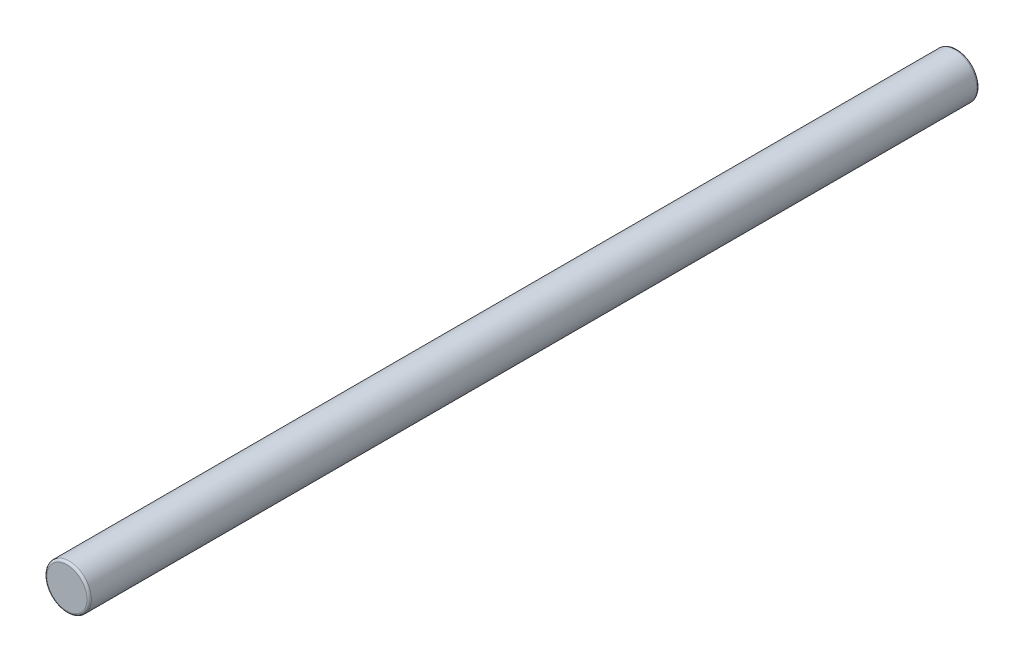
from build123d import *

# Parameters (mm, degrees)
ESQUISSE1_R      = 1
EXTRUSION1_DEPTH = 40
CONG_1_R         = 0.1


with BuildPart() as part:
    # Esquisse1 → Extrusion1 (new body)
    with BuildSketch(Plane.XY):
        Circle(ESQUISSE1_R)
    extrude(amount=EXTRUSION1_DEPTH)

    # Cong_1
    cong_1_edges = [part.edges().sort_by_distance(p)[0] for p in [
        (-1, 0, 0),
        (-1, 0, 40),
    ]]
    fillet(cong_1_edges, radius=CONG_1_R)


solid = part.part
